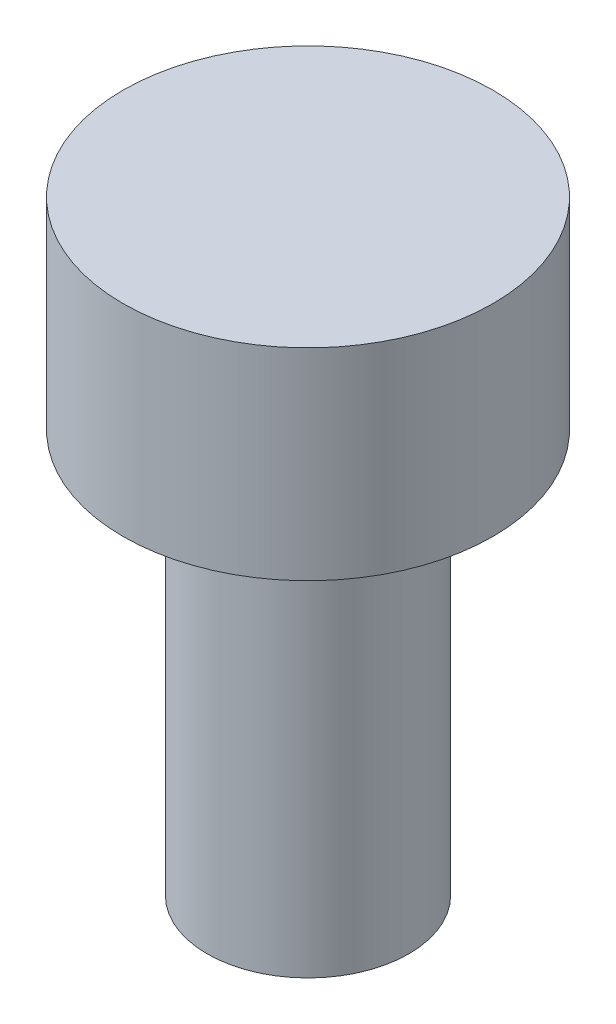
ISO-10303-21;
HEADER;
FILE_DESCRIPTION(('STEP AP214'),'2;1');
FILE_NAME('part.step','',(''),(''),'','','');
FILE_SCHEMA(('AUTOMOTIVE_DESIGN { 1 0 10303 214 1 1 1 1 }'));
ENDSEC;
DATA;
#1=APPLICATION_CONTEXT('core data for automotive mechanical design processes');
#2=APPLICATION_PROTOCOL_DEFINITION('international standard','automotive_design',2000,#1);
#3=PRODUCT_CONTEXT('',#1,'mechanical');
#4=PRODUCT('Part','Part','',(#3));
#5=PRODUCT_RELATED_PRODUCT_CATEGORY('part','',(#4));
#6=PRODUCT_DEFINITION_FORMATION('','',#4);
#7=PRODUCT_DEFINITION_CONTEXT('part definition',#1,'design');
#8=PRODUCT_DEFINITION('design','',#6,#7);
#9=PRODUCT_DEFINITION_SHAPE('','',#8);
#10=(LENGTH_UNIT() NAMED_UNIT(*) SI_UNIT(.MILLI.,.METRE.));
#11=(NAMED_UNIT(*) PLANE_ANGLE_UNIT() SI_UNIT($,.RADIAN.));
#12=(NAMED_UNIT(*) SI_UNIT($,.STERADIAN.) SOLID_ANGLE_UNIT());
#13=UNCERTAINTY_MEASURE_WITH_UNIT(LENGTH_MEASURE(1.E-05),#10,'distance_accuracy_value','');
#14=(GEOMETRIC_REPRESENTATION_CONTEXT(3) GLOBAL_UNCERTAINTY_ASSIGNED_CONTEXT((#13)) GLOBAL_UNIT_ASSIGNED_CONTEXT((#10,
#11,#12)) REPRESENTATION_CONTEXT('',''));
#15=CARTESIAN_POINT('',(0.,0.,0.));
#16=DIRECTION('',(0.,0.,1.));
#17=DIRECTION('',(1.,0.,0.));
#18=AXIS2_PLACEMENT_3D('',#15,#16,#17);
#19=CARTESIAN_POINT('',(0.,48.7,0.));
#20=DIRECTION('',(0.,-1.,0.));
#21=DIRECTION('',(0.,0.,-1.));
#22=AXIS2_PLACEMENT_3D('',#19,#20,#21);
#23=PLANE('',#22);
#24=CARTESIAN_POINT('',(0.,48.7,0.));
#25=DIRECTION('',(0.,1.,0.));
#26=DIRECTION('',(0.,0.,1.));
#27=AXIS2_PLACEMENT_3D('',#24,#25,#26);
#28=CIRCLE('',#27,1.5);
#29=CARTESIAN_POINT('',(0.,48.7,1.5));
#30=VERTEX_POINT('',#29);
#31=EDGE_CURVE('E21',#30,#30,#28,.T.);
#32=ORIENTED_EDGE('',*,*,#31,.F.);
#33=EDGE_LOOP('',(#32));
#34=FACE_BOUND('',#33,.T.);
#35=ADVANCED_FACE('F14',(#34),#23,.T.);
#36=CARTESIAN_POINT('',(0.,48.7,0.));
#37=DIRECTION('',(0.,1.,0.));
#38=DIRECTION('',(0.,0.,1.));
#39=AXIS2_PLACEMENT_3D('',#36,#37,#38);
#40=CYLINDRICAL_SURFACE('',#39,1.5);
#41=CARTESIAN_POINT('',(0.,54.7,0.));
#42=DIRECTION('',(0.,-1.,0.));
#43=DIRECTION('',(0.,0.,-1.));
#44=AXIS2_PLACEMENT_3D('',#41,#42,#43);
#45=CIRCLE('',#44,1.5);
#46=CARTESIAN_POINT('',(0.,54.7,-1.5));
#47=VERTEX_POINT('',#46);
#48=EDGE_CURVE('E9',#47,#47,#45,.F.);
#49=ORIENTED_EDGE('',*,*,#48,.F.);
#50=EDGE_LOOP('',(#49));
#51=FACE_BOUND('',#50,.T.);
#52=ORIENTED_EDGE('',*,*,#31,.T.);
#53=EDGE_LOOP('',(#52));
#54=FACE_BOUND('',#53,.T.);
#55=ADVANCED_FACE('F16',(#51,#54),#40,.T.);
#56=CARTESIAN_POINT('',(0.,57.7,0.));
#57=DIRECTION('',(0.,1.,0.));
#58=DIRECTION('',(0.,0.,1.));
#59=AXIS2_PLACEMENT_3D('',#56,#57,#58);
#60=PLANE('',#59);
#61=CARTESIAN_POINT('',(0.,57.7,0.));
#62=DIRECTION('',(0.,-1.,0.));
#63=DIRECTION('',(0.,0.,-1.));
#64=AXIS2_PLACEMENT_3D('',#61,#62,#63);
#65=CIRCLE('',#64,2.75);
#66=CARTESIAN_POINT('',(0.,57.7,-2.75));
#67=VERTEX_POINT('',#66);
#68=EDGE_CURVE('E25',#67,#67,#65,.T.);
#69=ORIENTED_EDGE('',*,*,#68,.F.);
#70=EDGE_LOOP('',(#69));
#71=FACE_BOUND('',#70,.T.);
#72=ADVANCED_FACE('F39',(#71),#60,.T.);
#73=CARTESIAN_POINT('',(0.,54.7,0.));
#74=DIRECTION('',(0.,-1.,0.));
#75=DIRECTION('',(0.,0.,-1.));
#76=AXIS2_PLACEMENT_3D('',#73,#74,#75);
#77=PLANE('',#76);
#78=ORIENTED_EDGE('',*,*,#48,.T.);
#79=EDGE_LOOP('',(#78));
#80=FACE_BOUND('',#79,.T.);
#81=CARTESIAN_POINT('',(0.,54.7,0.));
#82=DIRECTION('',(0.,1.,0.));
#83=DIRECTION('',(0.,0.,1.));
#84=AXIS2_PLACEMENT_3D('',#81,#82,#83);
#85=CIRCLE('',#84,2.75);
#86=CARTESIAN_POINT('',(0.,54.7,2.75));
#87=VERTEX_POINT('',#86);
#88=EDGE_CURVE('E26',#87,#87,#85,.T.);
#89=ORIENTED_EDGE('',*,*,#88,.F.);
#90=EDGE_LOOP('',(#89));
#91=FACE_BOUND('',#90,.T.);
#92=ADVANCED_FACE('F40',(#80,#91),#77,.T.);
#93=CARTESIAN_POINT('',(0.,54.7,0.));
#94=DIRECTION('',(0.,1.,0.));
#95=DIRECTION('',(0.,0.,1.));
#96=AXIS2_PLACEMENT_3D('',#93,#94,#95);
#97=CYLINDRICAL_SURFACE('',#96,2.75);
#98=ORIENTED_EDGE('',*,*,#68,.T.);
#99=EDGE_LOOP('',(#98));
#100=FACE_BOUND('',#99,.T.);
#101=ORIENTED_EDGE('',*,*,#88,.T.);
#102=EDGE_LOOP('',(#101));
#103=FACE_BOUND('',#102,.T.);
#104=ADVANCED_FACE('F34',(#100,#103),#97,.T.);
#105=CLOSED_SHELL('',(#35,#55,#72,#92,#104));
#106=MANIFOLD_SOLID_BREP('B1',#105);
#107=ADVANCED_BREP_SHAPE_REPRESENTATION('',(#18,#106),#14);
#108=SHAPE_DEFINITION_REPRESENTATION(#9,#107);
ENDSEC;
END-ISO-10303-21;
